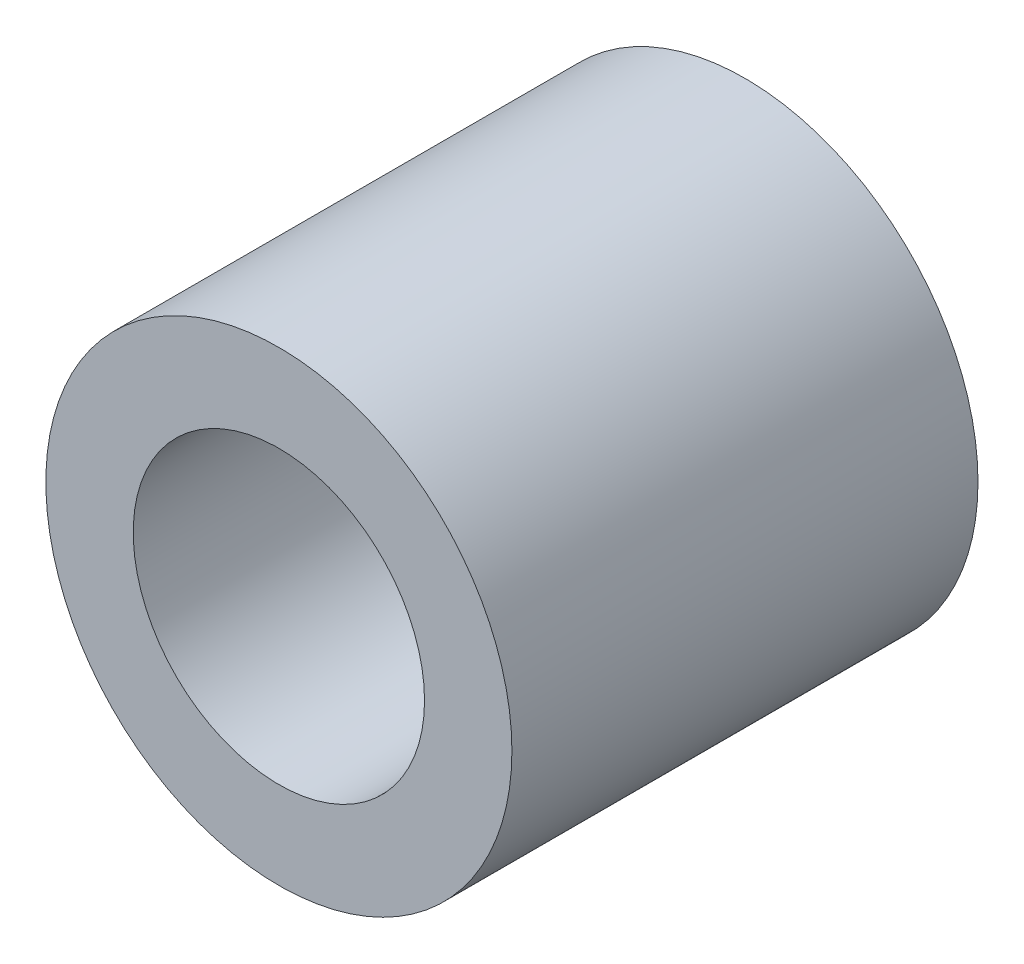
from build123d import *

# Parameters (mm, degrees)
IZIM1_R                     = 0.8
IZIM1_R_2                   = 0.5
Y_KSEKLIK_EKSTR_ZYON1_DEPTH = 1.6


with BuildPart() as part:
    # izim1 → Y_kseklik-Ekstr_zyon1 (new body)
    with BuildSketch(Plane.XY):
        Circle(IZIM1_R)
        Circle(IZIM1_R_2, mode=Mode.SUBTRACT)
    extrude(amount=Y_KSEKLIK_EKSTR_ZYON1_DEPTH)


solid = part.part
